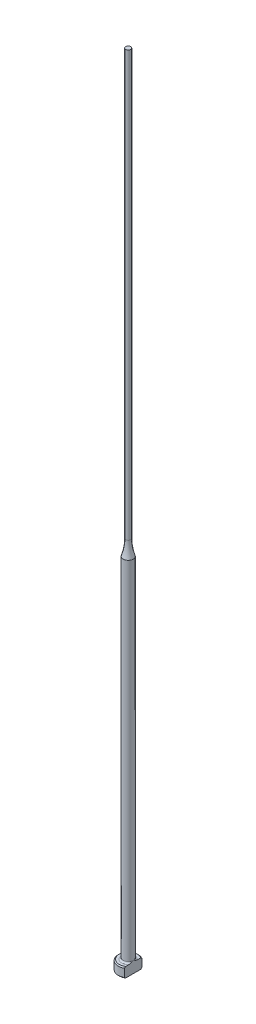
from build123d import *
from build123d.topology import SkipClean

# Parameters (mm, degrees)
CHAMFER1_SIZE = 0.2
FILLET1_R     = 0.3
KEY_DEPTH     = 161.024998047


with BuildPart() as part:
    # Sketch1 → Revolve1 (revolve)
    with BuildSketch(Plane.XY, mode=Mode.PRIVATE) as revolve1_sk:
        with BuildLine():
            Line((0, 0), (-2, 0))
            Line((-2, 0), (-2, 2))
            Line((-2, 2), (-1, 2))
            Line((-1, 2), (-1, 71.877501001))
            ThreePointArc((-1, 71.877501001), (-0.625791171, 73.41886117), (-0.5, 75))
            Line((-0.5, 75), (-0.5, 160))
            Line((-0.5, 160), (0, 160))
            Line((0, 160), (0, 0))
        make_face()
    revolve(revolve1_sk.sketch.rotate(Axis((0, 259.958771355, 0), (0, -1, 0)), 270), axis=Axis((0, 259.958771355, 0), (0, -1, 0)))

    # Chamfer1
    chamfer1_edges = [part.edges().sort_by_distance(p)[0] for p in [
        (0, 0, -2),
        (0, 2, -2),
    ]]
    chamfer(chamfer1_edges, length=CHAMFER1_SIZE)

    # Fillet1
    fillet1_edges = [part.edges().sort_by_distance(p)[0] for p in [
        (0, 2, -1),
    ]]
    fillet(fillet1_edges, radius=FILLET1_R)

    # Sketch2 → KEY (cut, through all)
    with SkipClean():  # the faces are left unmerged after this step: merging them gives an invalid solid
        with BuildSketch(Plane(origin=(0, 0, 0), x_dir=(1, 0, 0), z_dir=(0, 1, 0))):
            with BuildLine():
                Line((1, 1.732050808), (1, -1.732050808))
                ThreePointArc((1, -1.732050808), (2, 0), (1, 1.732050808))
            make_face()
        extrude(amount=KEY_DEPTH, mode=Mode.SUBTRACT)


solid = part.part
